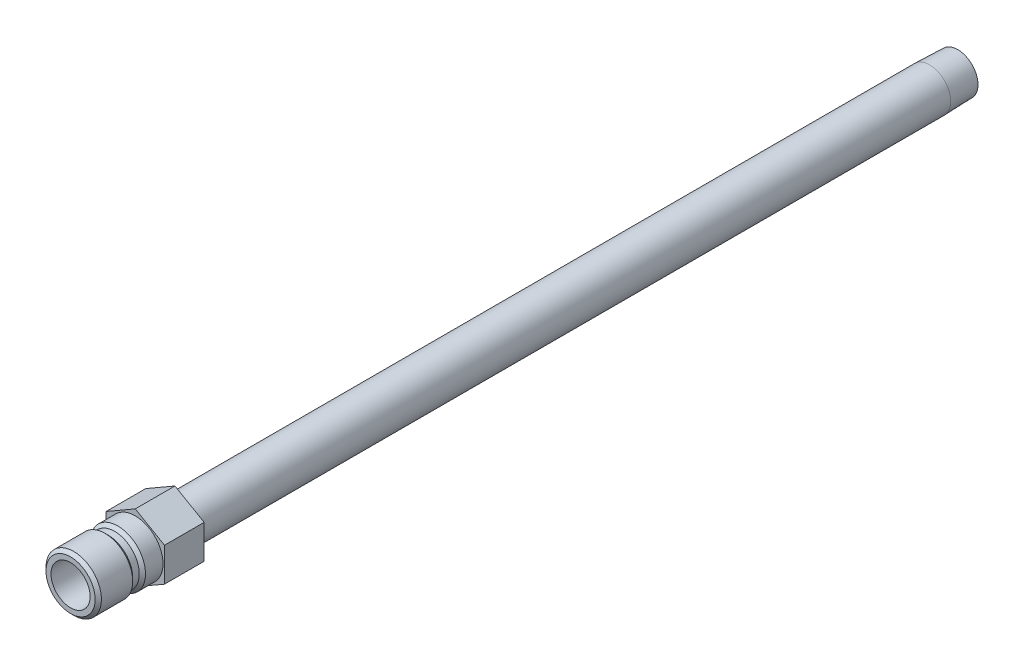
ISO-10303-21;
HEADER;
FILE_DESCRIPTION(('STEP AP214'),'2;1');
FILE_NAME('part.step','',(''),(''),'','','');
FILE_SCHEMA(('AUTOMOTIVE_DESIGN { 1 0 10303 214 1 1 1 1 }'));
ENDSEC;
DATA;
#1=APPLICATION_CONTEXT('core data for automotive mechanical design processes');
#2=APPLICATION_PROTOCOL_DEFINITION('international standard','automotive_design',2000,#1);
#3=PRODUCT_CONTEXT('',#1,'mechanical');
#4=PRODUCT('Part','Part','',(#3));
#5=PRODUCT_RELATED_PRODUCT_CATEGORY('part','',(#4));
#6=PRODUCT_DEFINITION_FORMATION('','',#4);
#7=PRODUCT_DEFINITION_CONTEXT('part definition',#1,'design');
#8=PRODUCT_DEFINITION('design','',#6,#7);
#9=PRODUCT_DEFINITION_SHAPE('','',#8);
#10=(LENGTH_UNIT() NAMED_UNIT(*) SI_UNIT(.MILLI.,.METRE.));
#11=(NAMED_UNIT(*) PLANE_ANGLE_UNIT() SI_UNIT($,.RADIAN.));
#12=(NAMED_UNIT(*) SI_UNIT($,.STERADIAN.) SOLID_ANGLE_UNIT());
#13=UNCERTAINTY_MEASURE_WITH_UNIT(LENGTH_MEASURE(1.E-05),#10,'distance_accuracy_value','');
#14=(GEOMETRIC_REPRESENTATION_CONTEXT(3) GLOBAL_UNCERTAINTY_ASSIGNED_CONTEXT((#13)) GLOBAL_UNIT_ASSIGNED_CONTEXT((#10,
#11,#12)) REPRESENTATION_CONTEXT('',''));
#15=CARTESIAN_POINT('',(0.,0.,0.));
#16=DIRECTION('',(0.,0.,1.));
#17=DIRECTION('',(1.,0.,0.));
#18=AXIS2_PLACEMENT_3D('',#15,#16,#17);
#19=CARTESIAN_POINT('',(0.,0.,-9.652));
#20=DIRECTION('',(0.,0.,-1.));
#21=DIRECTION('',(0.,1.,0.));
#22=AXIS2_PLACEMENT_3D('',#19,#20,#21);
#23=CYLINDRICAL_SURFACE('',#22,4.7625);
#24=CARTESIAN_POINT('',(0.,0.,3.556));
#25=DIRECTION('',(0.,0.,-1.));
#26=DIRECTION('',(0.,1.,0.));
#27=AXIS2_PLACEMENT_3D('',#24,#25,#26);
#28=CIRCLE('',#27,4.7625);
#29=CARTESIAN_POINT('',(0.,4.7625,3.556));
#30=VERTEX_POINT('',#29);
#31=EDGE_CURVE('E137',#30,#30,#28,.T.);
#32=ORIENTED_EDGE('',*,*,#31,.T.);
#33=EDGE_LOOP('',(#32));
#34=FACE_BOUND('',#33,.T.);
#35=CARTESIAN_POINT('',(0.,0.,15.748));
#36=DIRECTION('',(0.,0.,-1.));
#37=DIRECTION('',(0.,1.,0.));
#38=AXIS2_PLACEMENT_3D('',#35,#36,#37);
#39=CIRCLE('',#38,4.7625);
#40=CARTESIAN_POINT('',(0.,4.7625,15.748));
#41=VERTEX_POINT('',#40);
#42=EDGE_CURVE('E41',#41,#41,#39,.T.);
#43=ORIENTED_EDGE('',*,*,#42,.F.);
#44=EDGE_LOOP('',(#43));
#45=FACE_BOUND('',#44,.T.);
#46=ADVANCED_FACE('F33',(#34,#45),#23,.F.);
#47=CARTESIAN_POINT('',(0.,4.7625,15.748));
#48=DIRECTION('',(0.,0.,1.));
#49=DIRECTION('',(0.,-1.,0.));
#50=AXIS2_PLACEMENT_3D('',#47,#48,#49);
#51=PLANE('',#50);
#52=ORIENTED_EDGE('',*,*,#42,.T.);
#53=EDGE_LOOP('',(#52));
#54=FACE_BOUND('',#53,.T.);
#55=CARTESIAN_POINT('',(0.,0.,15.748));
#56=DIRECTION('',(0.,0.,-1.));
#57=DIRECTION('',(0.,1.,0.));
#58=AXIS2_PLACEMENT_3D('',#55,#56,#57);
#59=CIRCLE('',#58,5.9817);
#60=CARTESIAN_POINT('',(0.,5.9817,15.748));
#61=VERTEX_POINT('',#60);
#62=EDGE_CURVE('E175',#61,#61,#59,.T.);
#63=ORIENTED_EDGE('',*,*,#62,.F.);
#64=EDGE_LOOP('',(#63));
#65=FACE_BOUND('',#64,.T.);
#66=ADVANCED_FACE('F180',(#54,#65),#51,.T.);
#67=CARTESIAN_POINT('',(0.,0.,14.986));
#68=DIRECTION('',(0.,0.,-1.));
#69=DIRECTION('',(0.,1.,0.));
#70=AXIS2_PLACEMENT_3D('',#67,#68,#69);
#71=CONICAL_SURFACE('',#70,6.7437,0.785398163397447);
#72=ORIENTED_EDGE('',*,*,#62,.T.);
#73=EDGE_LOOP('',(#72));
#74=FACE_BOUND('',#73,.T.);
#75=CARTESIAN_POINT('',(0.,0.,14.986));
#76=DIRECTION('',(0.,0.,-1.));
#77=DIRECTION('',(0.,1.,0.));
#78=AXIS2_PLACEMENT_3D('',#75,#76,#77);
#79=CIRCLE('',#78,6.7437);
#80=CARTESIAN_POINT('',(0.,6.7437,14.986));
#81=VERTEX_POINT('',#80);
#82=EDGE_CURVE('E172',#81,#81,#79,.T.);
#83=ORIENTED_EDGE('',*,*,#82,.F.);
#84=EDGE_LOOP('',(#83));
#85=FACE_BOUND('',#84,.T.);
#86=ADVANCED_FACE('F188',(#74,#85),#71,.T.);
#87=CARTESIAN_POINT('',(0.,0.,-9.652));
#88=DIRECTION('',(0.,0.,-1.));
#89=DIRECTION('',(0.,1.,0.));
#90=AXIS2_PLACEMENT_3D('',#87,#88,#89);
#91=CYLINDRICAL_SURFACE('',#90,6.7437);
#92=ORIENTED_EDGE('',*,*,#82,.T.);
#93=EDGE_LOOP('',(#92));
#94=FACE_BOUND('',#93,.T.);
#95=CARTESIAN_POINT('',(0.,0.,7.366));
#96=DIRECTION('',(0.,0.,-1.));
#97=DIRECTION('',(0.,1.,0.));
#98=AXIS2_PLACEMENT_3D('',#95,#96,#97);
#99=CIRCLE('',#98,6.7437);
#100=CARTESIAN_POINT('',(0.,6.7437,7.366));
#101=VERTEX_POINT('',#100);
#102=EDGE_CURVE('E169',#101,#101,#99,.T.);
#103=ORIENTED_EDGE('',*,*,#102,.F.);
#104=EDGE_LOOP('',(#103));
#105=FACE_BOUND('',#104,.T.);
#106=ADVANCED_FACE('F237',(#94,#105),#91,.T.);
#107=CARTESIAN_POINT('',(0.,0.,6.604));
#108=DIRECTION('',(0.,0.,1.));
#109=DIRECTION('',(0.,-1.,0.));
#110=AXIS2_PLACEMENT_3D('',#107,#108,#109);
#111=CONICAL_SURFACE('',#110,5.9817,0.785398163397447);
#112=ORIENTED_EDGE('',*,*,#102,.T.);
#113=EDGE_LOOP('',(#112));
#114=FACE_BOUND('',#113,.T.);
#115=CARTESIAN_POINT('',(0.,0.,6.604));
#116=DIRECTION('',(0.,0.,-1.));
#117=DIRECTION('',(0.,1.,0.));
#118=AXIS2_PLACEMENT_3D('',#115,#116,#117);
#119=CIRCLE('',#118,5.9817);
#120=CARTESIAN_POINT('',(0.,5.9817,6.604));
#121=VERTEX_POINT('',#120);
#122=EDGE_CURVE('E166',#121,#121,#119,.T.);
#123=ORIENTED_EDGE('',*,*,#122,.F.);
#124=EDGE_LOOP('',(#123));
#125=FACE_BOUND('',#124,.T.);
#126=ADVANCED_FACE('F233',(#114,#125),#111,.T.);
#127=CARTESIAN_POINT('',(0.,0.,-9.652));
#128=DIRECTION('',(0.,0.,-1.));
#129=DIRECTION('',(0.,1.,0.));
#130=AXIS2_PLACEMENT_3D('',#127,#128,#129);
#131=CYLINDRICAL_SURFACE('',#130,5.9817);
#132=ORIENTED_EDGE('',*,*,#122,.T.);
#133=EDGE_LOOP('',(#132));
#134=FACE_BOUND('',#133,.T.);
#135=CARTESIAN_POINT('',(0.,0.,5.0165));
#136=DIRECTION('',(0.,0.,-1.));
#137=DIRECTION('',(0.,1.,0.));
#138=AXIS2_PLACEMENT_3D('',#135,#136,#137);
#139=CIRCLE('',#138,5.9817);
#140=CARTESIAN_POINT('',(0.,5.9817,5.0165));
#141=VERTEX_POINT('',#140);
#142=EDGE_CURVE('E163',#141,#141,#139,.T.);
#143=ORIENTED_EDGE('',*,*,#142,.F.);
#144=EDGE_LOOP('',(#143));
#145=FACE_BOUND('',#144,.T.);
#146=ADVANCED_FACE('F229',(#134,#145),#131,.T.);
#147=CARTESIAN_POINT('',(0.,0.,4.2545));
#148=DIRECTION('',(0.,0.,-1.));
#149=DIRECTION('',(0.,1.,0.));
#150=AXIS2_PLACEMENT_3D('',#147,#148,#149);
#151=CONICAL_SURFACE('',#150,6.7437,0.785398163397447);
#152=ORIENTED_EDGE('',*,*,#142,.T.);
#153=EDGE_LOOP('',(#152));
#154=FACE_BOUND('',#153,.T.);
#155=CARTESIAN_POINT('',(0.,0.,4.2545));
#156=DIRECTION('',(0.,0.,-1.));
#157=DIRECTION('',(0.,1.,0.));
#158=AXIS2_PLACEMENT_3D('',#155,#156,#157);
#159=CIRCLE('',#158,6.7437);
#160=CARTESIAN_POINT('',(0.,6.7437,4.2545));
#161=VERTEX_POINT('',#160);
#162=EDGE_CURVE('E160',#161,#161,#159,.T.);
#163=ORIENTED_EDGE('',*,*,#162,.F.);
#164=EDGE_LOOP('',(#163));
#165=FACE_BOUND('',#164,.T.);
#166=ADVANCED_FACE('F225',(#154,#165),#151,.T.);
#167=CARTESIAN_POINT('',(0.,0.,-9.652));
#168=DIRECTION('',(0.,0.,-1.));
#169=DIRECTION('',(0.,1.,0.));
#170=AXIS2_PLACEMENT_3D('',#167,#168,#169);
#171=CYLINDRICAL_SURFACE('',#170,6.7437);
#172=CARTESIAN_POINT('',(0.,0.,0.));
#173=DIRECTION('',(0.,0.,1.));
#174=DIRECTION('',(1.,0.,0.));
#175=AXIS2_PLACEMENT_3D('',#172,#173,#174);
#176=CIRCLE('',#175,6.7437);
#177=CARTESIAN_POINT('',(6.7437,0.,0.));
#178=VERTEX_POINT('',#177);
#179=EDGE_CURVE('E11',#178,#178,#176,.F.);
#180=ORIENTED_EDGE('',*,*,#179,.F.);
#181=EDGE_LOOP('',(#180));
#182=FACE_BOUND('',#181,.T.);
#183=ORIENTED_EDGE('',*,*,#162,.T.);
#184=EDGE_LOOP('',(#183));
#185=FACE_BOUND('',#184,.T.);
#186=ADVANCED_FACE('F221',(#182,#185),#171,.T.);
#187=CARTESIAN_POINT('',(0.,6.7437,-9.652));
#188=DIRECTION('',(0.,0.,-1.));
#189=DIRECTION('',(0.,1.,0.));
#190=AXIS2_PLACEMENT_3D('',#187,#188,#189);
#191=PLANE('',#190);
#192=CARTESIAN_POINT('',(0.,0.,-9.652));
#193=DIRECTION('',(0.,0.,-1.));
#194=DIRECTION('',(0.,1.,0.));
#195=AXIS2_PLACEMENT_3D('',#192,#193,#194);
#196=CIRCLE('',#195,5.1435);
#197=CARTESIAN_POINT('',(0.,5.1435,-9.652));
#198=VERTEX_POINT('',#197);
#199=EDGE_CURVE('E157',#198,#198,#196,.T.);
#200=ORIENTED_EDGE('',*,*,#199,.F.);
#201=EDGE_LOOP('',(#200));
#202=FACE_BOUND('',#201,.T.);
#203=DIRECTION('',(-0.866025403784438,-0.5,0.));
#204=VECTOR('',#203,1.);
#205=CARTESIAN_POINT('',(0.,8.21223022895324,-9.652));
#206=LINE('',#205,#204);
#207=CARTESIAN_POINT('',(0.,8.21223022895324,-9.652));
#208=VERTEX_POINT('',#207);
#209=CARTESIAN_POINT('',(-7.112,4.10611511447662,-9.652));
#210=VERTEX_POINT('',#209);
#211=EDGE_CURVE('E135',#208,#210,#206,.T.);
#212=ORIENTED_EDGE('',*,*,#211,.F.);
#213=DIRECTION('',(-0.866025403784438,0.5,0.));
#214=VECTOR('',#213,1.);
#215=CARTESIAN_POINT('',(7.112,4.10611511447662,-9.652));
#216=LINE('',#215,#214);
#217=CARTESIAN_POINT('',(7.112,4.10611511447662,-9.652));
#218=VERTEX_POINT('',#217);
#219=EDGE_CURVE('E110',#218,#208,#216,.T.);
#220=ORIENTED_EDGE('',*,*,#219,.F.);
#221=DIRECTION('',(0.,1.,0.));
#222=VECTOR('',#221,1.);
#223=CARTESIAN_POINT('',(7.112,-4.10611511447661,-9.652));
#224=LINE('',#223,#222);
#225=CARTESIAN_POINT('',(7.112,-4.10611511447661,-9.652));
#226=VERTEX_POINT('',#225);
#227=EDGE_CURVE('E95',#226,#218,#224,.T.);
#228=ORIENTED_EDGE('',*,*,#227,.F.);
#229=DIRECTION('',(0.866025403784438,0.5,0.));
#230=VECTOR('',#229,1.);
#231=CARTESIAN_POINT('',(0.,-8.21223022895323,-9.652));
#232=LINE('',#231,#230);
#233=CARTESIAN_POINT('',(0.,-8.21223022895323,-9.652));
#234=VERTEX_POINT('',#233);
#235=EDGE_CURVE('E108',#234,#226,#232,.T.);
#236=ORIENTED_EDGE('',*,*,#235,.F.);
#237=DIRECTION('',(0.866025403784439,-0.5,0.));
#238=VECTOR('',#237,1.);
#239=CARTESIAN_POINT('',(-7.112,-4.10611511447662,-9.652));
#240=LINE('',#239,#238);
#241=CARTESIAN_POINT('',(-7.112,-4.10611511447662,-9.652));
#242=VERTEX_POINT('',#241);
#243=EDGE_CURVE('E113',#242,#234,#240,.T.);
#244=ORIENTED_EDGE('',*,*,#243,.F.);
#245=DIRECTION('',(0.,-1.,0.));
#246=VECTOR('',#245,1.);
#247=CARTESIAN_POINT('',(-7.112,4.10611511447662,-9.652));
#248=LINE('',#247,#246);
#249=EDGE_CURVE('E115',#210,#242,#248,.T.);
#250=ORIENTED_EDGE('',*,*,#249,.F.);
#251=EDGE_LOOP('',(#212,#220,#228,#236,#244,#250));
#252=FACE_BOUND('',#251,.T.);
#253=ADVANCED_FACE('F106',(#202,#252),#191,.T.);
#254=CARTESIAN_POINT('',(0.,0.,-9.652));
#255=DIRECTION('',(0.,0.,-1.));
#256=DIRECTION('',(0.,1.,0.));
#257=AXIS2_PLACEMENT_3D('',#254,#255,#256);
#258=CYLINDRICAL_SURFACE('',#257,5.14349999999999);
#259=ORIENTED_EDGE('',*,*,#199,.T.);
#260=EDGE_LOOP('',(#259));
#261=FACE_BOUND('',#260,.T.);
#262=CARTESIAN_POINT('',(0.,0.,-193.294));
#263=DIRECTION('',(0.,0.,-1.));
#264=DIRECTION('',(0.,1.,0.));
#265=AXIS2_PLACEMENT_3D('',#262,#263,#264);
#266=CIRCLE('',#265,5.14349999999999);
#267=CARTESIAN_POINT('',(0.,5.1435,-193.294));
#268=VERTEX_POINT('',#267);
#269=EDGE_CURVE('E154',#268,#268,#266,.T.);
#270=ORIENTED_EDGE('',*,*,#269,.F.);
#271=EDGE_LOOP('',(#270));
#272=FACE_BOUND('',#271,.T.);
#273=ADVANCED_FACE('F214',(#261,#272),#258,.T.);
#274=CARTESIAN_POINT('',(0.,0.,-200.152));
#275=DIRECTION('',(0.,0.,1.));
#276=DIRECTION('',(0.,-1.,0.));
#277=AXIS2_PLACEMENT_3D('',#274,#275,#276);
#278=CONICAL_SURFACE('',#277,4.92918877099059,0.0312396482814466);
#279=ORIENTED_EDGE('',*,*,#269,.T.);
#280=EDGE_LOOP('',(#279));
#281=FACE_BOUND('',#280,.T.);
#282=CARTESIAN_POINT('',(0.,0.,-200.152));
#283=DIRECTION('',(0.,0.,-1.));
#284=DIRECTION('',(0.,1.,0.));
#285=AXIS2_PLACEMENT_3D('',#282,#283,#284);
#286=CIRCLE('',#285,4.92918877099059);
#287=CARTESIAN_POINT('',(0.,4.9291887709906,-200.152));
#288=VERTEX_POINT('',#287);
#289=EDGE_CURVE('E151',#288,#288,#286,.T.);
#290=ORIENTED_EDGE('',*,*,#289,.F.);
#291=EDGE_LOOP('',(#290));
#292=FACE_BOUND('',#291,.T.);
#293=ADVANCED_FACE('F210',(#281,#292),#278,.T.);
#294=CARTESIAN_POINT('',(0.,4.9291887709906,-200.152));
#295=DIRECTION('',(0.,0.,-1.));
#296=DIRECTION('',(0.,1.,0.));
#297=AXIS2_PLACEMENT_3D('',#294,#295,#296);
#298=PLANE('',#297);
#299=ORIENTED_EDGE('',*,*,#289,.T.);
#300=EDGE_LOOP('',(#299));
#301=FACE_BOUND('',#300,.T.);
#302=CARTESIAN_POINT('',(0.,0.,-200.152));
#303=DIRECTION('',(0.,0.,-1.));
#304=DIRECTION('',(0.,1.,0.));
#305=AXIS2_PLACEMENT_3D('',#302,#303,#304);
#306=CIRCLE('',#305,3.41629999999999);
#307=CARTESIAN_POINT('',(0.,3.4163,-200.152));
#308=VERTEX_POINT('',#307);
#309=EDGE_CURVE('E148',#308,#308,#306,.T.);
#310=ORIENTED_EDGE('',*,*,#309,.F.);
#311=EDGE_LOOP('',(#310));
#312=FACE_BOUND('',#311,.T.);
#313=ADVANCED_FACE('F203',(#301,#312),#298,.T.);
#314=CARTESIAN_POINT('',(0.,0.,-9.652));
#315=DIRECTION('',(0.,0.,-1.));
#316=DIRECTION('',(0.,1.,0.));
#317=AXIS2_PLACEMENT_3D('',#314,#315,#316);
#318=CYLINDRICAL_SURFACE('',#317,3.41629999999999);
#319=ORIENTED_EDGE('',*,*,#309,.T.);
#320=EDGE_LOOP('',(#319));
#321=FACE_BOUND('',#320,.T.);
#322=CARTESIAN_POINT('',(0.,0.,2.84021276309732));
#323=DIRECTION('',(0.,0.,-1.));
#324=DIRECTION('',(0.,1.,0.));
#325=AXIS2_PLACEMENT_3D('',#322,#323,#324);
#326=CIRCLE('',#325,3.4163);
#327=CARTESIAN_POINT('',(0.,3.4163,2.84021276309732));
#328=VERTEX_POINT('',#327);
#329=EDGE_CURVE('E145',#328,#328,#326,.T.);
#330=ORIENTED_EDGE('',*,*,#329,.F.);
#331=EDGE_LOOP('',(#330));
#332=FACE_BOUND('',#331,.T.);
#333=ADVANCED_FACE('F194',(#321,#332),#318,.F.);
#334=CARTESIAN_POINT('',(0.,0.,3.556));
#335=DIRECTION('',(0.,0.,1.));
#336=DIRECTION('',(0.,-1.,0.));
#337=AXIS2_PLACEMENT_3D('',#334,#335,#336);
#338=CONICAL_SURFACE('',#337,4.7625,1.08210413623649);
#339=ORIENTED_EDGE('',*,*,#329,.T.);
#340=EDGE_LOOP('',(#339));
#341=FACE_BOUND('',#340,.T.);
#342=ORIENTED_EDGE('',*,*,#31,.F.);
#343=EDGE_LOOP('',(#342));
#344=FACE_BOUND('',#343,.T.);
#345=ADVANCED_FACE('F191',(#341,#344),#338,.F.);
#346=CARTESIAN_POINT('',(0.,8.21223022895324,-9.652));
#347=DIRECTION('',(-0.5,0.866025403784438,0.));
#348=DIRECTION('',(-0.866025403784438,-0.5,0.));
#349=AXIS2_PLACEMENT_3D('',#346,#347,#348);
#350=PLANE('',#349);
#351=DIRECTION('',(-0.866025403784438,-0.5,0.));
#352=VECTOR('',#351,1.);
#353=CARTESIAN_POINT('',(0.,8.21223022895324,0.));
#354=LINE('',#353,#352);
#355=CARTESIAN_POINT('',(0.,8.21223022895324,0.));
#356=VERTEX_POINT('',#355);
#357=CARTESIAN_POINT('',(-7.112,4.10611511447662,0.));
#358=VERTEX_POINT('',#357);
#359=EDGE_CURVE('E120',#356,#358,#354,.T.);
#360=ORIENTED_EDGE('',*,*,#359,.F.);
#361=DIRECTION('',(0.,0.,1.));
#362=VECTOR('',#361,1.);
#363=CARTESIAN_POINT('',(0.,8.21223022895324,-9.652));
#364=LINE('',#363,#362);
#365=EDGE_CURVE('E49',#208,#356,#364,.T.);
#366=ORIENTED_EDGE('',*,*,#365,.F.);
#367=ORIENTED_EDGE('',*,*,#211,.T.);
#368=DIRECTION('',(0.,0.,1.));
#369=VECTOR('',#368,1.);
#370=CARTESIAN_POINT('',(-7.112,4.10611511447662,-9.652));
#371=LINE('',#370,#369);
#372=EDGE_CURVE('E84',#210,#358,#371,.T.);
#373=ORIENTED_EDGE('',*,*,#372,.T.);
#374=EDGE_LOOP('',(#360,#366,#367,#373));
#375=FACE_BOUND('',#374,.T.);
#376=ADVANCED_FACE('F193',(#375),#350,.T.);
#377=CARTESIAN_POINT('',(7.112,4.10611511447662,-9.652));
#378=DIRECTION('',(0.5,0.866025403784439,0.));
#379=DIRECTION('',(-0.866025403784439,0.5,0.));
#380=AXIS2_PLACEMENT_3D('',#377,#378,#379);
#381=PLANE('',#380);
#382=DIRECTION('',(-0.866025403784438,0.5,0.));
#383=VECTOR('',#382,1.);
#384=CARTESIAN_POINT('',(7.112,4.10611511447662,0.));
#385=LINE('',#384,#383);
#386=CARTESIAN_POINT('',(7.112,4.10611511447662,0.));
#387=VERTEX_POINT('',#386);
#388=EDGE_CURVE('E132',#387,#356,#385,.T.);
#389=ORIENTED_EDGE('',*,*,#388,.F.);
#390=DIRECTION('',(0.,0.,1.));
#391=VECTOR('',#390,1.);
#392=CARTESIAN_POINT('',(7.112,4.10611511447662,-9.652));
#393=LINE('',#392,#391);
#394=EDGE_CURVE('E72',#218,#387,#393,.T.);
#395=ORIENTED_EDGE('',*,*,#394,.F.);
#396=ORIENTED_EDGE('',*,*,#219,.T.);
#397=ORIENTED_EDGE('',*,*,#365,.T.);
#398=EDGE_LOOP('',(#389,#395,#396,#397));
#399=FACE_BOUND('',#398,.T.);
#400=ADVANCED_FACE('F201',(#399),#381,.T.);
#401=CARTESIAN_POINT('',(7.112,-4.10611511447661,-9.652));
#402=DIRECTION('',(1.,0.,0.));
#403=DIRECTION('',(0.,1.,0.));
#404=AXIS2_PLACEMENT_3D('',#401,#402,#403);
#405=PLANE('',#404);
#406=DIRECTION('',(0.,1.,0.));
#407=VECTOR('',#406,1.);
#408=CARTESIAN_POINT('',(7.112,-4.10611511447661,0.));
#409=LINE('',#408,#407);
#410=CARTESIAN_POINT('',(7.112,-4.10611511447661,0.));
#411=VERTEX_POINT('',#410);
#412=EDGE_CURVE('E97',#411,#387,#409,.T.);
#413=ORIENTED_EDGE('',*,*,#412,.F.);
#414=DIRECTION('',(0.,0.,1.));
#415=VECTOR('',#414,1.);
#416=CARTESIAN_POINT('',(7.112,-4.10611511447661,-9.652));
#417=LINE('',#416,#415);
#418=EDGE_CURVE('E92',#226,#411,#417,.T.);
#419=ORIENTED_EDGE('',*,*,#418,.F.);
#420=ORIENTED_EDGE('',*,*,#227,.T.);
#421=ORIENTED_EDGE('',*,*,#394,.T.);
#422=EDGE_LOOP('',(#413,#419,#420,#421));
#423=FACE_BOUND('',#422,.T.);
#424=ADVANCED_FACE('F94',(#423),#405,.T.);
#425=CARTESIAN_POINT('',(0.,-8.21223022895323,-9.652));
#426=DIRECTION('',(0.5,-0.866025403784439,0.));
#427=DIRECTION('',(0.866025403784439,0.5,0.));
#428=AXIS2_PLACEMENT_3D('',#425,#426,#427);
#429=PLANE('',#428);
#430=DIRECTION('',(0.866025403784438,0.5,0.));
#431=VECTOR('',#430,1.);
#432=CARTESIAN_POINT('',(0.,-8.21223022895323,0.));
#433=LINE('',#432,#431);
#434=CARTESIAN_POINT('',(0.,-8.21223022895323,0.));
#435=VERTEX_POINT('',#434);
#436=EDGE_CURVE('E129',#435,#411,#433,.T.);
#437=ORIENTED_EDGE('',*,*,#436,.F.);
#438=DIRECTION('',(0.,0.,1.));
#439=VECTOR('',#438,1.);
#440=CARTESIAN_POINT('',(0.,-8.21223022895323,-9.652));
#441=LINE('',#440,#439);
#442=EDGE_CURVE('E102',#234,#435,#441,.T.);
#443=ORIENTED_EDGE('',*,*,#442,.F.);
#444=ORIENTED_EDGE('',*,*,#235,.T.);
#445=ORIENTED_EDGE('',*,*,#418,.T.);
#446=EDGE_LOOP('',(#437,#443,#444,#445));
#447=FACE_BOUND('',#446,.T.);
#448=ADVANCED_FACE('F112',(#447),#429,.T.);
#449=CARTESIAN_POINT('',(-7.112,-4.10611511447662,-9.652));
#450=DIRECTION('',(-0.5,-0.866025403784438,0.));
#451=DIRECTION('',(0.866025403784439,-0.5,0.));
#452=AXIS2_PLACEMENT_3D('',#449,#450,#451);
#453=PLANE('',#452);
#454=DIRECTION('',(0.866025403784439,-0.5,0.));
#455=VECTOR('',#454,1.);
#456=CARTESIAN_POINT('',(-7.112,-4.10611511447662,0.));
#457=LINE('',#456,#455);
#458=CARTESIAN_POINT('',(-7.112,-4.10611511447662,0.));
#459=VERTEX_POINT('',#458);
#460=EDGE_CURVE('E126',#459,#435,#457,.T.);
#461=ORIENTED_EDGE('',*,*,#460,.F.);
#462=DIRECTION('',(0.,0.,1.));
#463=VECTOR('',#462,1.);
#464=CARTESIAN_POINT('',(-7.112,-4.10611511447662,-9.652));
#465=LINE('',#464,#463);
#466=EDGE_CURVE('E140',#242,#459,#465,.T.);
#467=ORIENTED_EDGE('',*,*,#466,.F.);
#468=ORIENTED_EDGE('',*,*,#243,.T.);
#469=ORIENTED_EDGE('',*,*,#442,.T.);
#470=EDGE_LOOP('',(#461,#467,#468,#469));
#471=FACE_BOUND('',#470,.T.);
#472=ADVANCED_FACE('F338',(#471),#453,.T.);
#473=CARTESIAN_POINT('',(-7.112,4.10611511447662,-9.652));
#474=DIRECTION('',(-1.,0.,0.));
#475=DIRECTION('',(0.,-1.,0.));
#476=AXIS2_PLACEMENT_3D('',#473,#474,#475);
#477=PLANE('',#476);
#478=DIRECTION('',(0.,-1.,0.));
#479=VECTOR('',#478,1.);
#480=CARTESIAN_POINT('',(-7.112,4.10611511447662,0.));
#481=LINE('',#480,#479);
#482=EDGE_CURVE('E123',#358,#459,#481,.T.);
#483=ORIENTED_EDGE('',*,*,#482,.F.);
#484=ORIENTED_EDGE('',*,*,#372,.F.);
#485=ORIENTED_EDGE('',*,*,#249,.T.);
#486=ORIENTED_EDGE('',*,*,#466,.T.);
#487=EDGE_LOOP('',(#483,#484,#485,#486));
#488=FACE_BOUND('',#487,.T.);
#489=ADVANCED_FACE('F346',(#488),#477,.T.);
#490=CARTESIAN_POINT('',(-7.112,4.10611511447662,0.));
#491=DIRECTION('',(0.,0.,1.));
#492=DIRECTION('',(1.,0.,0.));
#493=AXIS2_PLACEMENT_3D('',#490,#491,#492);
#494=PLANE('',#493);
#495=ORIENTED_EDGE('',*,*,#179,.T.);
#496=EDGE_LOOP('',(#495));
#497=FACE_BOUND('',#496,.T.);
#498=ORIENTED_EDGE('',*,*,#359,.T.);
#499=ORIENTED_EDGE('',*,*,#482,.T.);
#500=ORIENTED_EDGE('',*,*,#460,.T.);
#501=ORIENTED_EDGE('',*,*,#436,.T.);
#502=ORIENTED_EDGE('',*,*,#412,.T.);
#503=ORIENTED_EDGE('',*,*,#388,.T.);
#504=EDGE_LOOP('',(#498,#499,#500,#501,#502,#503));
#505=FACE_BOUND('',#504,.T.);
#506=ADVANCED_FACE('F355',(#497,#505),#494,.T.);
#507=CLOSED_SHELL('',(#46,#66,#86,#106,#126,#146,#166,#186,#253,#273,#293,#313,#333,#345,#376,
#400,#424,#448,#472,#489,#506));
#508=MANIFOLD_SOLID_BREP('B2',#507);
#509=ADVANCED_BREP_SHAPE_REPRESENTATION('',(#18,#508),#14);
#510=SHAPE_DEFINITION_REPRESENTATION(#9,#509);
ENDSEC;
END-ISO-10303-21;
